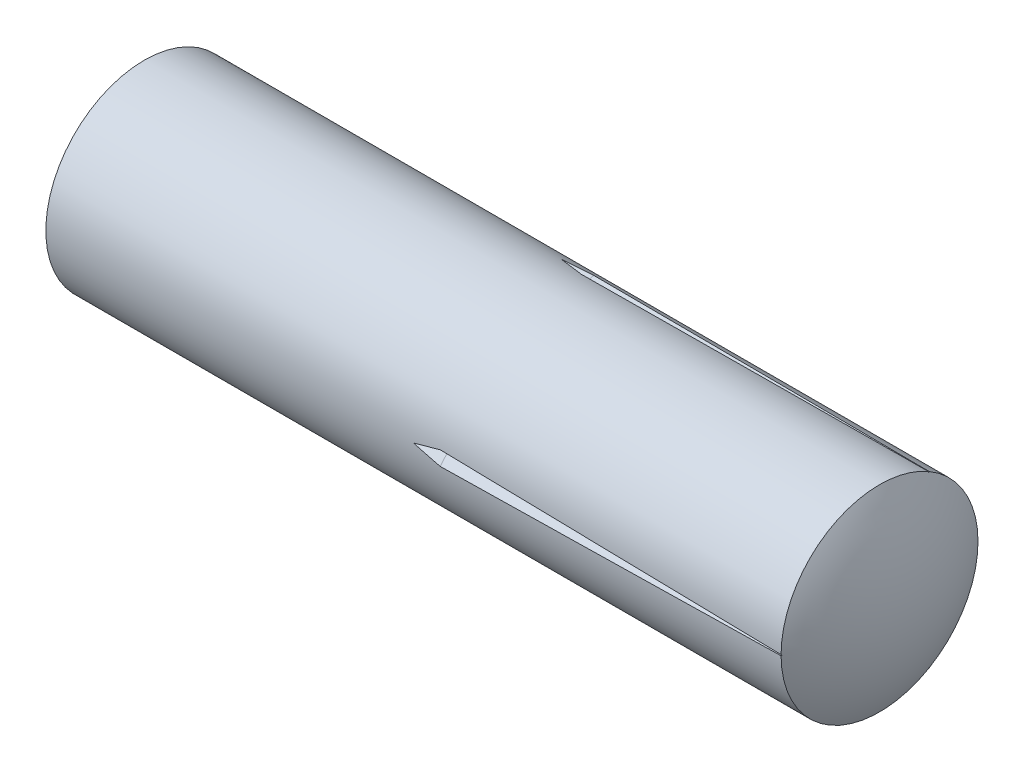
ISO-10303-21;
HEADER;
FILE_DESCRIPTION(('STEP AP214'),'2;1');
FILE_NAME('part.step','',(''),(''),'','','');
FILE_SCHEMA(('AUTOMOTIVE_DESIGN { 1 0 10303 214 1 1 1 1 }'));
ENDSEC;
DATA;
#1=APPLICATION_CONTEXT('core data for automotive mechanical design processes');
#2=APPLICATION_PROTOCOL_DEFINITION('international standard','automotive_design',2000,#1);
#3=PRODUCT_CONTEXT('',#1,'mechanical');
#4=PRODUCT('Part','Part','',(#3));
#5=PRODUCT_RELATED_PRODUCT_CATEGORY('part','',(#4));
#6=PRODUCT_DEFINITION_FORMATION('','',#4);
#7=PRODUCT_DEFINITION_CONTEXT('part definition',#1,'design');
#8=PRODUCT_DEFINITION('design','',#6,#7);
#9=PRODUCT_DEFINITION_SHAPE('','',#8);
#10=(LENGTH_UNIT() NAMED_UNIT(*) SI_UNIT(.MILLI.,.METRE.));
#11=(NAMED_UNIT(*) PLANE_ANGLE_UNIT() SI_UNIT($,.RADIAN.));
#12=(NAMED_UNIT(*) SI_UNIT($,.STERADIAN.) SOLID_ANGLE_UNIT());
#13=UNCERTAINTY_MEASURE_WITH_UNIT(LENGTH_MEASURE(1.E-05),#10,'distance_accuracy_value','');
#14=(GEOMETRIC_REPRESENTATION_CONTEXT(3) GLOBAL_UNCERTAINTY_ASSIGNED_CONTEXT((#13)) GLOBAL_UNIT_ASSIGNED_CONTEXT((#10,
#11,#12)) REPRESENTATION_CONTEXT('',''));
#15=CARTESIAN_POINT('',(0.,0.,0.));
#16=DIRECTION('',(0.,0.,1.));
#17=DIRECTION('',(1.,0.,0.));
#18=AXIS2_PLACEMENT_3D('',#15,#16,#17);
#19=CARTESIAN_POINT('',(-25.0312695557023,0.,0.));
#20=DIRECTION('',(-1.,0.,0.));
#21=DIRECTION('',(0.,1.,0.));
#22=AXIS2_PLACEMENT_3D('',#19,#20,#21);
#23=SPHERICAL_SURFACE('',#22,25.);
#24=CARTESIAN_POINT('',(-50.,0.,0.));
#25=DIRECTION('',(-1.,0.,0.));
#26=DIRECTION('',(0.,0.,1.));
#27=AXIS2_PLACEMENT_3D('',#24,#25,#26);
#28=CIRCLE('',#27,1.25);
#29=CARTESIAN_POINT('',(-50.,1.25000000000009,0.));
#30=VERTEX_POINT('',#29);
#31=EDGE_CURVE('E181',#30,#30,#28,.T.);
#32=CARTESIAN_POINT('',(-46.6819046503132,0.,0.));
#33=DIRECTION('',(-1.,0.,0.));
#34=DIRECTION('',(0.,0.,1.));
#35=AXIS2_PLACEMENT_3D('',#32,#33,#34);
#36=CIRCLE('',#35,12.5);
#37=CARTESIAN_POINT('',(-46.6819046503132,12.5,0.));
#38=VERTEX_POINT('',#37);
#39=EDGE_CURVE('E174',#38,#38,#36,.T.);
#40=CARTESIAN_POINT('',(-50.,1.25000000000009,0.));
#41=CARTESIAN_POINT('',(-49.9938336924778,1.37317333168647,0.));
#42=CARTESIAN_POINT('',(-49.9867558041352,1.49630102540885,0.));
#43=CARTESIAN_POINT('',(-49.9707787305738,1.74243819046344,0.));
#44=CARTESIAN_POINT('',(-49.9618795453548,1.86544766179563,0.));
#45=CARTESIAN_POINT('',(-49.942261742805,2.11132143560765,0.));
#46=CARTESIAN_POINT('',(-49.931543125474,2.23418573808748,0.));
#47=CARTESIAN_POINT('',(-49.9082888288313,2.47974226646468,0.));
#48=CARTESIAN_POINT('',(-49.8957531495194,2.60243449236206,0.));
#49=CARTESIAN_POINT('',(-49.8688674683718,2.84761999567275,0.));
#50=CARTESIAN_POINT('',(-49.854517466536,2.97011327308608,0.));
#51=CARTESIAN_POINT('',(-49.8240062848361,3.21487405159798,0.));
#52=CARTESIAN_POINT('',(-49.8078451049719,3.33714155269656,0.));
#53=CARTESIAN_POINT('',(-49.7737151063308,3.58142400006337,0.));
#54=CARTESIAN_POINT('',(-49.7557462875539,3.70343894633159,0.));
#55=CARTESIAN_POINT('',(-49.718004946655,3.94718956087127,0.));
#56=CARTESIAN_POINT('',(-49.698232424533,4.06892522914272,0.));
#57=CARTESIAN_POINT('',(-49.6568880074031,4.31209062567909,0.));
#58=CARTESIAN_POINT('',(-49.6353161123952,4.433520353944,0.));
#59=CARTESIAN_POINT('',(-49.5903776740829,4.67604727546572,0.));
#60=CARTESIAN_POINT('',(-49.5670111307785,4.79714446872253,0.));
#61=CARTESIAN_POINT('',(-49.5184885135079,5.03897979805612,0.));
#62=CARTESIAN_POINT('',(-49.4933324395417,5.15971793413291,0.));
#63=CARTESIAN_POINT('',(-49.4412362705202,5.40080870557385,0.));
#64=CARTESIAN_POINT('',(-49.414296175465,5.521161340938,0.));
#65=CARTESIAN_POINT('',(-49.3586378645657,5.76145475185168,0.));
#66=CARTESIAN_POINT('',(-49.3299196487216,5.8813955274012,0.));
#67=CARTESIAN_POINT('',(-49.2707113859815,6.12083894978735,0.));
#68=CARTESIAN_POINT('',(-49.2402213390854,6.24034159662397,0.));
#69=CARTESIAN_POINT('',(-49.1774760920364,6.47888258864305,0.));
#70=CARTESIAN_POINT('',(-49.1452208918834,6.59792093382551,0.));
#71=CARTESIAN_POINT('',(-49.078952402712,6.83550725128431,0.));
#72=CARTESIAN_POINT('',(-49.0449391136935,6.95405522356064,0.));
#73=CARTESIAN_POINT('',(-48.9751618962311,7.19063483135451,0.));
#74=CARTESIAN_POINT('',(-48.9393979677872,7.30866646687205,0.));
#75=CARTESIAN_POINT('',(-48.8661273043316,7.54418755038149,0.));
#76=CARTESIAN_POINT('',(-48.8286205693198,7.66167699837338,0.));
#77=CARTESIAN_POINT('',(-48.7518725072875,7.89608797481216,0.));
#78=CARTESIAN_POINT('',(-48.712631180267,8.01300950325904,0.));
#79=CARTESIAN_POINT('',(-48.6324225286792,8.24625903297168,0.));
#80=CARTESIAN_POINT('',(-48.5914552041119,8.36258703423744,0.));
#81=CARTESIAN_POINT('',(-48.5078035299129,8.59462403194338,0.));
#82=CARTESIAN_POINT('',(-48.4651191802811,8.71033302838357,0.));
#83=CARTESIAN_POINT('',(-48.3780428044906,8.94110667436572,0.));
#84=CARTESIAN_POINT('',(-48.3336507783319,9.05617132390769,0.));
#85=CARTESIAN_POINT('',(-48.2431687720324,9.28563107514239,0.));
#86=CARTESIAN_POINT('',(-48.1970787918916,9.40002617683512,0.));
#87=CARTESIAN_POINT('',(-48.1032109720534,9.62812177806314,0.));
#88=CARTESIAN_POINT('',(-48.055433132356,9.74182227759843,0.));
#89=CARTESIAN_POINT('',(-47.9582000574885,9.96850377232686,0.));
#90=CARTESIAN_POINT('',(-47.9087448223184,10.08148476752,0.));
#91=CARTESIAN_POINT('',(-47.8081677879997,10.3067025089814,0.));
#92=CARTESIAN_POINT('',(-47.7570459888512,10.4189392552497,0.));
#93=CARTESIAN_POINT('',(-47.653147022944,10.6426439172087,0.));
#94=CARTESIAN_POINT('',(-47.6003698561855,10.7541118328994,0.));
#95=CARTESIAN_POINT('',(-47.4931717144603,10.9762544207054,0.));
#96=CARTESIAN_POINT('',(-47.4387507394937,11.0869290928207,0.));
#97=CARTESIAN_POINT('',(-47.3282768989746,11.307460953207,0.));
#98=CARTESIAN_POINT('',(-47.272224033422,11.417318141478,0.));
#99=CARTESIAN_POINT('',(-47.1584986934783,11.6361909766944,0.));
#100=CARTESIAN_POINT('',(-47.1008262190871,11.7452066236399,0.));
#101=CARTESIAN_POINT('',(-46.9838742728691,11.9623724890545,0.));
#102=CARTESIAN_POINT('',(-46.9245948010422,12.0705227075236,0.));
#103=CARTESIAN_POINT('',(-46.8044419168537,12.2859340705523,0.));
#104=CARTESIAN_POINT('',(-46.743568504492,12.3931952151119,0.));
#105=CARTESIAN_POINT('',(-46.6819046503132,12.5,0.));
#106=B_SPLINE_CURVE_WITH_KNOTS('',3,(#40,#41,#42,#43,#44,#45,#46,#47,#48,#49,#50,#51,#52,#53,
#54,#55,#56,#57,#58,#59,#60,#61,#62,#63,#64,#65,#66,#67,#68,#69,#70,#71,#72,#73,#74,#75,#76,#77,
#78,#79,#80,#81,#82,#83,#84,#85,#86,#87,#88,#89,#90,#91,#92,#93,#94,#95,#96,#97,#98,#99,#100,
#101,#102,#103,#104,#105),.UNSPECIFIED.,.F.,.F.,(4,2,2,2,2,2,2,2,2,2,2,2,2,2,2,2,2,2,2,2,2,2,2,
2,2,2,2,2,2,2,2,2,4),(0.,0.369979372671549,0.739958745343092,1.10993811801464,1.47991749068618,
1.84989686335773,2.21987623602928,2.58985560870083,2.95983498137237,3.32981435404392,
3.69979372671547,4.06977309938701,4.43975247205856,4.8097318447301,5.17971121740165,
5.5496905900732,5.91966996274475,6.28964933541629,6.65962870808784,7.02960808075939,
7.39958745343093,7.76956682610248,8.13954619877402,8.50952557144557,8.87950494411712,
9.24948431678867,9.61946368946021,9.98944306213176,10.3594224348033,10.7294018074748,
11.0993811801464,11.4693605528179,11.8393399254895),.UNSPECIFIED.);
#107=EDGE_CURVE('BSEAM36',#30,#38,#106,.T.);
#108=ORIENTED_EDGE('',*,*,#31,.F.);
#109=ORIENTED_EDGE('',*,*,#39,.T.);
#110=ORIENTED_EDGE('',*,*,#107,.T.);
#111=ORIENTED_EDGE('',*,*,#107,.F.);
#112=EDGE_LOOP('',(#108,#110,#109,#111));
#113=FACE_BOUND('',#112,.T.);
#114=ADVANCED_FACE('F36',(#113),#23,.T.);
#115=CARTESIAN_POINT('',(-50.,0.,0.));
#116=DIRECTION('',(1.,0.,0.));
#117=DIRECTION('',(0.,0.,-1.));
#118=AXIS2_PLACEMENT_3D('',#115,#116,#117);
#119=PLANE('',#118);
#120=ORIENTED_EDGE('',*,*,#31,.T.);
#121=EDGE_LOOP('',(#120));
#122=FACE_BOUND('',#121,.T.);
#123=ADVANCED_FACE('F238',(#122),#119,.F.);
#124=CARTESIAN_POINT('',(25.,0.,0.));
#125=DIRECTION('',(-1.,0.,0.));
#126=DIRECTION('',(0.,1.,0.));
#127=AXIS2_PLACEMENT_3D('',#124,#125,#126);
#128=SPHERICAL_SURFACE('',#127,25.);
#129=CARTESIAN_POINT('',(46.6506350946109,0.,0.));
#130=DIRECTION('',(-1.,0.,0.));
#131=DIRECTION('',(0.,0.,1.));
#132=AXIS2_PLACEMENT_3D('',#129,#130,#131);
#133=CIRCLE('',#132,12.5);
#134=CARTESIAN_POINT('',(46.6506350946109,10.7915623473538,-6.30810447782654));
#135=VERTEX_POINT('',#134);
#136=CARTESIAN_POINT('',(46.650635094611,-10.7915623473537,-6.30810447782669));
#137=VERTEX_POINT('',#136);
#138=EDGE_CURVE('E182',#135,#137,#133,.T.);
#139=ORIENTED_EDGE('',*,*,#138,.F.);
#140=CARTESIAN_POINT('',(24.8856783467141,6.55604170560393,2.78127333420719));
#141=DIRECTION('',(0.0160507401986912,-0.920467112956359,-0.390490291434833));
#142=DIRECTION('',(0.,0.390540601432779,-0.920585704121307));
#143=AXIS2_PLACEMENT_3D('',#140,#141,#142);
#144=CIRCLE('',#143,23.9639263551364);
#145=CARTESIAN_POINT('',(46.7011859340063,10.7491346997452,-6.20601581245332));
#146=VERTEX_POINT('',#145);
#147=EDGE_CURVE('E141',#135,#146,#144,.T.);
#148=ORIENTED_EDGE('',*,*,#147,.T.);
#149=CARTESIAN_POINT('',(24.8856783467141,0.869367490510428,-7.06833533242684));
#150=DIRECTION('',(0.0160507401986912,-0.122059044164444,0.992393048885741));
#151=DIRECTION('',(0.,-0.992520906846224,-0.122074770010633));
#152=AXIS2_PLACEMENT_3D('',#149,#150,#151);
#153=CIRCLE('',#152,23.9639263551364);
#154=CARTESIAN_POINT('',(46.6506350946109,10.8587599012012,-6.19171490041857));
#155=VERTEX_POINT('',#154);
#156=EDGE_CURVE('E127',#146,#155,#153,.T.);
#157=ORIENTED_EDGE('',*,*,#156,.T.);
#158=CARTESIAN_POINT('',(46.650635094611,0.0671975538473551,12.4998193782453));
#159=VERTEX_POINT('',#158);
#160=EDGE_CURVE('E178',#159,#155,#133,.T.);
#161=ORIENTED_EDGE('',*,*,#160,.F.);
#162=CARTESIAN_POINT('',(24.8856783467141,-5.68667421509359,4.28706199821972));
#163=DIRECTION('',(0.0160507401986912,0.798408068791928,-0.601902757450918));
#164=DIRECTION('',(0.,0.601980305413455,0.798510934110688));
#165=AXIS2_PLACEMENT_3D('',#162,#163,#164);
#166=CIRCLE('',#165,23.9639263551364);
#167=CARTESIAN_POINT('',(46.7011859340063,0.,12.4120316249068));
#168=VERTEX_POINT('',#167);
#169=EDGE_CURVE('E171',#159,#168,#166,.T.);
#170=ORIENTED_EDGE('',*,*,#169,.T.);
#171=CARTESIAN_POINT('',(24.8856783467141,5.6866742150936,4.28706199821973));
#172=DIRECTION('',(0.0160507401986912,-0.798408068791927,-0.601902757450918));
#173=DIRECTION('',(0.,0.601980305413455,-0.798510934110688));
#174=AXIS2_PLACEMENT_3D('',#171,#172,#173);
#175=CIRCLE('',#174,23.9639263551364);
#176=CARTESIAN_POINT('',(46.6506350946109,-0.0671975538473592,12.4998193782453));
#177=VERTEX_POINT('',#176);
#178=EDGE_CURVE('E168',#168,#177,#175,.T.);
#179=ORIENTED_EDGE('',*,*,#178,.T.);
#180=CARTESIAN_POINT('',(46.650635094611,-10.8587599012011,-6.19171490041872));
#181=VERTEX_POINT('',#180);
#182=EDGE_CURVE('E177',#181,#177,#133,.T.);
#183=ORIENTED_EDGE('',*,*,#182,.F.);
#184=CARTESIAN_POINT('',(24.8856783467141,-0.869367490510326,-7.06833533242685));
#185=DIRECTION('',(0.0160507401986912,0.12205904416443,0.992393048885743));
#186=DIRECTION('',(0.,-0.992520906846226,0.122074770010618));
#187=AXIS2_PLACEMENT_3D('',#184,#185,#186);
#188=CIRCLE('',#187,23.9639263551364);
#189=CARTESIAN_POINT('',(46.7011859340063,-10.7491346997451,-6.20601581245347));
#190=VERTEX_POINT('',#189);
#191=EDGE_CURVE('E155',#181,#190,#188,.T.);
#192=ORIENTED_EDGE('',*,*,#191,.T.);
#193=CARTESIAN_POINT('',(24.8856783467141,-6.55604170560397,2.78127333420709));
#194=DIRECTION('',(0.0160507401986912,0.920467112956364,-0.390490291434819));
#195=DIRECTION('',(0.,0.390540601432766,0.920585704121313));
#196=AXIS2_PLACEMENT_3D('',#193,#194,#195);
#197=CIRCLE('',#196,23.9639263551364);
#198=EDGE_CURVE('E152',#190,#137,#197,.T.);
#199=ORIENTED_EDGE('',*,*,#198,.T.);
#200=EDGE_LOOP('',(#139,#148,#157,#161,#170,#179,#183,#192,#199));
#201=FACE_BOUND('',#200,.T.);
#202=ADVANCED_FACE('F212',(#201),#128,.T.);
#203=CARTESIAN_POINT('',(-57.,0.,0.));
#204=DIRECTION('',(-1.,0.,0.));
#205=DIRECTION('',(0.,0.,1.));
#206=AXIS2_PLACEMENT_3D('',#203,#204,#205);
#207=CYLINDRICAL_SURFACE('',#206,12.5);
#208=ORIENTED_EDGE('',*,*,#39,.F.);
#209=EDGE_LOOP('',(#208));
#210=FACE_BOUND('',#209,.T.);
#211=CARTESIAN_POINT('',(31.25,0.,0.));
#212=DIRECTION('',(0.223620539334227,0.883356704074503,0.411915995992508));
#213=DIRECTION('',(-0.974676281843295,0.202669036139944,0.0945061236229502));
#214=AXIS2_PLACEMENT_3D('',#211,#212,#213);
#215=ELLIPSE('',#214,55.8982642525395,12.5);
#216=CARTESIAN_POINT('',(3.34252354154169,10.340007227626,-7.02383446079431));
#217=VERTEX_POINT('',#216);
#218=CARTESIAN_POINT('',(0.,10.8253175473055,-6.2499999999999));
#219=VERTEX_POINT('',#218);
#220=EDGE_CURVE('E137',#217,#219,#215,.T.);
#221=ORIENTED_EDGE('',*,*,#220,.F.);
#222=CARTESIAN_POINT('',(-418.749999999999,0.,0.));
#223=DIRECTION('',(0.0160507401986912,-0.920467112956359,-0.390490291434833));
#224=DIRECTION('',(-0.999871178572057,-0.0147760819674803,-0.00626846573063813));
#225=AXIS2_PLACEMENT_3D('',#222,#223,#224);
#226=ELLIPSE('',#225,778.780283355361,12.5);
#227=EDGE_CURVE('E12',#217,#135,#226,.T.);
#228=ORIENTED_EDGE('',*,*,#227,.T.);
#229=ORIENTED_EDGE('',*,*,#138,.T.);
#230=CARTESIAN_POINT('',(-418.75,0.,0.));
#231=DIRECTION('',(0.0160507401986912,0.920467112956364,-0.390490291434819));
#232=DIRECTION('',(-0.999871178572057,0.0147760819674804,-0.00626846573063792));
#233=AXIS2_PLACEMENT_3D('',#230,#231,#232);
#234=ELLIPSE('',#233,778.780283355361,12.5);
#235=CARTESIAN_POINT('',(3.34252354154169,-10.3400072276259,-7.02383446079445));
#236=VERTEX_POINT('',#235);
#237=EDGE_CURVE('E200',#137,#236,#234,.T.);
#238=ORIENTED_EDGE('',*,*,#237,.T.);
#239=CARTESIAN_POINT('',(31.25,0.,0.));
#240=DIRECTION('',(0.223620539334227,-0.883356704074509,0.411915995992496));
#241=DIRECTION('',(-0.974676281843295,-0.202669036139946,0.0945061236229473));
#242=AXIS2_PLACEMENT_3D('',#239,#240,#241);
#243=ELLIPSE('',#242,55.8982642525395,12.5);
#244=CARTESIAN_POINT('',(0.,-10.8253175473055,-6.25000000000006));
#245=VERTEX_POINT('',#244);
#246=EDGE_CURVE('E196',#245,#236,#243,.T.);
#247=ORIENTED_EDGE('',*,*,#246,.F.);
#248=CARTESIAN_POINT('',(31.25,0.,0.));
#249=DIRECTION('',(0.223620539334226,-0.0849486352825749,-0.970967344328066));
#250=DIRECTION('',(-0.974676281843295,-0.0194898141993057,-0.222769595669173));
#251=AXIS2_PLACEMENT_3D('',#248,#249,#250);
#252=ELLIPSE('',#251,55.8982642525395,12.5);
#253=CARTESIAN_POINT('',(3.34252354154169,-11.2528226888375,-5.44279170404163));
#254=VERTEX_POINT('',#253);
#255=EDGE_CURVE('E198',#254,#245,#252,.T.);
#256=ORIENTED_EDGE('',*,*,#255,.F.);
#257=CARTESIAN_POINT('',(-418.75,0.,0.));
#258=DIRECTION('',(0.0160507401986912,0.12205904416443,0.992393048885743));
#259=DIRECTION('',(-0.999871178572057,0.00195939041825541,0.0159306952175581));
#260=AXIS2_PLACEMENT_3D('',#257,#258,#259);
#261=ELLIPSE('',#260,778.780283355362,12.5);
#262=EDGE_CURVE('E203',#254,#181,#261,.T.);
#263=ORIENTED_EDGE('',*,*,#262,.T.);
#264=ORIENTED_EDGE('',*,*,#182,.T.);
#265=CARTESIAN_POINT('',(-418.749999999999,0.,0.));
#266=DIRECTION('',(0.0160507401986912,-0.798408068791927,-0.601902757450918));
#267=DIRECTION('',(-0.999871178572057,-0.0128166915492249,-0.00966222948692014));
#268=AXIS2_PLACEMENT_3D('',#265,#266,#267);
#269=ELLIPSE('',#268,778.780283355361,12.5);
#270=CARTESIAN_POINT('',(3.34252354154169,-0.912815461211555,12.466626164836));
#271=VERTEX_POINT('',#270);
#272=EDGE_CURVE('E190',#177,#271,#269,.T.);
#273=ORIENTED_EDGE('',*,*,#272,.T.);
#274=CARTESIAN_POINT('',(31.25,0.,0.));
#275=DIRECTION('',(0.223620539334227,0.798408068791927,0.559051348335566));
#276=DIRECTION('',(-0.974676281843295,0.183179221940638,0.128263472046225));
#277=AXIS2_PLACEMENT_3D('',#274,#275,#276);
#278=ELLIPSE('',#277,55.8982642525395,12.5);
#279=CARTESIAN_POINT('',(0.,0.,12.5));
#280=VERTEX_POINT('',#279);
#281=EDGE_CURVE('E185',#280,#271,#278,.T.);
#282=ORIENTED_EDGE('',*,*,#281,.F.);
#283=CARTESIAN_POINT('',(31.25,0.,0.));
#284=DIRECTION('',(0.223620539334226,-0.798408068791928,0.559051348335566));
#285=DIRECTION('',(-0.974676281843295,-0.183179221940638,0.128263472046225));
#286=AXIS2_PLACEMENT_3D('',#283,#284,#285);
#287=ELLIPSE('',#286,55.8982642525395,12.5);
#288=CARTESIAN_POINT('',(3.34252354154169,0.912815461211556,12.466626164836));
#289=VERTEX_POINT('',#288);
#290=EDGE_CURVE('E187',#289,#280,#287,.T.);
#291=ORIENTED_EDGE('',*,*,#290,.F.);
#292=CARTESIAN_POINT('',(-418.75,0.,0.));
#293=DIRECTION('',(0.0160507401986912,0.798408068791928,-0.601902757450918));
#294=DIRECTION('',(-0.999871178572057,0.0128166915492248,-0.00966222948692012));
#295=AXIS2_PLACEMENT_3D('',#292,#293,#294);
#296=ELLIPSE('',#295,778.780283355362,12.5);
#297=EDGE_CURVE('E193',#289,#159,#296,.T.);
#298=ORIENTED_EDGE('',*,*,#297,.T.);
#299=ORIENTED_EDGE('',*,*,#160,.T.);
#300=CARTESIAN_POINT('',(-418.75,0.,0.));
#301=DIRECTION('',(0.0160507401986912,-0.122059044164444,0.992393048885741));
#302=DIRECTION('',(-0.999871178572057,-0.00195939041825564,0.0159306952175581));
#303=AXIS2_PLACEMENT_3D('',#300,#301,#302);
#304=ELLIPSE('',#303,778.780283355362,12.5);
#305=CARTESIAN_POINT('',(3.34252354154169,11.2528226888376,-5.44279170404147));
#306=VERTEX_POINT('',#305);
#307=EDGE_CURVE('E43',#155,#306,#304,.T.);
#308=ORIENTED_EDGE('',*,*,#307,.T.);
#309=CARTESIAN_POINT('',(31.25,0.,0.));
#310=DIRECTION('',(0.223620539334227,0.084948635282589,-0.970967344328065));
#311=DIRECTION('',(-0.974676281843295,0.0194898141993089,-0.222769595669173));
#312=AXIS2_PLACEMENT_3D('',#309,#310,#311);
#313=ELLIPSE('',#312,55.8982642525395,12.5);
#314=EDGE_CURVE('E117',#219,#306,#313,.T.);
#315=ORIENTED_EDGE('',*,*,#314,.F.);
#316=EDGE_LOOP('',(#221,#228,#229,#238,#247,#256,#263,#264,#273,#282,#291,#298,#299,#308,#315));
#317=FACE_BOUND('',#316,.T.);
#318=ADVANCED_FACE('F208',(#210,#317),#207,.T.);
#319=CARTESIAN_POINT('',(3.04669241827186,-0.328609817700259,10.8120195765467));
#320=DIRECTION('',(0.0160507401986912,0.798408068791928,-0.601902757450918));
#321=DIRECTION('',(0.,0.601980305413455,0.798510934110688));
#322=AXIS2_PLACEMENT_3D('',#319,#320,#321);
#323=PLANE('',#322);
#324=ORIENTED_EDGE('',*,*,#297,.F.);
#325=DIRECTION('',(0.141573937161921,0.594100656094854,0.791834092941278));
#326=VECTOR('',#325,1.);
#327=CARTESIAN_POINT('',(3.04669241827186,-0.328609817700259,10.8120195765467));
#328=LINE('',#327,#326);
#329=CARTESIAN_POINT('',(3.125,0.,11.25));
#330=VERTEX_POINT('',#329);
#331=EDGE_CURVE('E159',#330,#289,#328,.T.);
#332=ORIENTED_EDGE('',*,*,#331,.F.);
#333=DIRECTION('',(0.999644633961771,0.,0.0266571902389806));
#334=VECTOR('',#333,1.);
#335=CARTESIAN_POINT('',(3.125,0.,11.25));
#336=LINE('',#335,#334);
#337=EDGE_CURVE('E165',#330,#168,#336,.T.);
#338=ORIENTED_EDGE('',*,*,#337,.T.);
#339=ORIENTED_EDGE('',*,*,#169,.F.);
#340=EDGE_LOOP('',(#324,#332,#338,#339));
#341=FACE_BOUND('',#340,.T.);
#342=ADVANCED_FACE('F249',(#341),#323,.F.);
#343=CARTESIAN_POINT('',(3.04669241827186,0.328609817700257,10.8120195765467));
#344=DIRECTION('',(0.0160507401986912,-0.798408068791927,-0.601902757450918));
#345=DIRECTION('',(0.,0.601980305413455,-0.798510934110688));
#346=AXIS2_PLACEMENT_3D('',#343,#344,#345);
#347=PLANE('',#346);
#348=ORIENTED_EDGE('',*,*,#337,.F.);
#349=DIRECTION('',(-0.141573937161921,0.594100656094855,-0.791834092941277));
#350=VECTOR('',#349,1.);
#351=CARTESIAN_POINT('',(3.04669241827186,0.328609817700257,10.8120195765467));
#352=LINE('',#351,#350);
#353=EDGE_CURVE('E162',#271,#330,#352,.T.);
#354=ORIENTED_EDGE('',*,*,#353,.F.);
#355=ORIENTED_EDGE('',*,*,#272,.F.);
#356=ORIENTED_EDGE('',*,*,#178,.F.);
#357=EDGE_LOOP('',(#348,#354,#355,#356));
#358=FACE_BOUND('',#357,.T.);
#359=ADVANCED_FACE('F255',(#358),#347,.F.);
#360=CARTESIAN_POINT('',(6.28281228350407,0.,9.98687508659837));
#361=DIRECTION('',(0.223620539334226,-0.798408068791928,0.559051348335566));
#362=DIRECTION('',(0.,-0.573576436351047,-0.819152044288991));
#363=AXIS2_PLACEMENT_3D('',#360,#361,#362);
#364=PLANE('',#363);
#365=ORIENTED_EDGE('',*,*,#290,.T.);
#366=DIRECTION('',(-0.928476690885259,0.,0.371390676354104));
#367=VECTOR('',#366,1.);
#368=CARTESIAN_POINT('',(6.28281228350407,0.,9.98687508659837));
#369=LINE('',#368,#367);
#370=EDGE_CURVE('E158',#330,#280,#369,.T.);
#371=ORIENTED_EDGE('',*,*,#370,.F.);
#372=ORIENTED_EDGE('',*,*,#331,.T.);
#373=EDGE_LOOP('',(#365,#371,#372));
#374=FACE_BOUND('',#373,.T.);
#375=ADVANCED_FACE('F261',(#374),#364,.T.);
#376=CARTESIAN_POINT('',(6.28281228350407,0.,9.98687508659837));
#377=DIRECTION('',(0.223620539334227,0.798408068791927,0.559051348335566));
#378=DIRECTION('',(0.,-0.573576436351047,0.819152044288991));
#379=AXIS2_PLACEMENT_3D('',#376,#377,#378);
#380=PLANE('',#379);
#381=ORIENTED_EDGE('',*,*,#281,.T.);
#382=ORIENTED_EDGE('',*,*,#353,.T.);
#383=ORIENTED_EDGE('',*,*,#370,.T.);
#384=EDGE_LOOP('',(#381,#382,#383));
#385=FACE_BOUND('',#384,.T.);
#386=ADVANCED_FACE('F264',(#385),#380,.T.);
#387=CARTESIAN_POINT('',(3.04468501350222,-9.18524341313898,-5.69227573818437));
#388=DIRECTION('',(0.0160507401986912,0.12205904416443,0.992393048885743));
#389=DIRECTION('',(0.,-0.992520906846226,0.122074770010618));
#390=AXIS2_PLACEMENT_3D('',#387,#388,#389);
#391=PLANE('',#390);
#392=ORIENTED_EDGE('',*,*,#262,.F.);
#393=DIRECTION('',(0.141573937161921,-0.982798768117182,0.118589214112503));
#394=VECTOR('',#393,1.);
#395=CARTESIAN_POINT('',(3.04468501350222,-9.18524341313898,-5.69227573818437));
#396=LINE('',#395,#394);
#397=CARTESIAN_POINT('',(3.125,-9.74278579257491,-5.62500000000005));
#398=VERTEX_POINT('',#397);
#399=EDGE_CURVE('E143',#398,#254,#396,.T.);
#400=ORIENTED_EDGE('',*,*,#399,.F.);
#401=DIRECTION('',(0.999644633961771,-0.0230858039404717,-0.0133285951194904));
#402=VECTOR('',#401,1.);
#403=CARTESIAN_POINT('',(3.125,-9.74278579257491,-5.62500000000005));
#404=LINE('',#403,#402);
#405=EDGE_CURVE('E149',#398,#190,#404,.T.);
#406=ORIENTED_EDGE('',*,*,#405,.T.);
#407=ORIENTED_EDGE('',*,*,#191,.F.);
#408=EDGE_LOOP('',(#392,#400,#406,#407));
#409=FACE_BOUND('',#408,.T.);
#410=ADVANCED_FACE('F221',(#409),#391,.F.);
#411=CARTESIAN_POINT('',(3.04468501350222,-9.52227710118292,-5.10851626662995));
#412=DIRECTION('',(0.0160507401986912,0.920467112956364,-0.390490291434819));
#413=DIRECTION('',(0.,0.390540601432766,0.920585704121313));
#414=AXIS2_PLACEMENT_3D('',#411,#412,#413);
#415=PLANE('',#414);
#416=ORIENTED_EDGE('',*,*,#405,.F.);
#417=DIRECTION('',(-0.141573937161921,0.388698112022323,0.910423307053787));
#418=VECTOR('',#417,1.);
#419=CARTESIAN_POINT('',(3.04468501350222,-9.52227710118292,-5.10851626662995));
#420=LINE('',#419,#418);
#421=EDGE_CURVE('E146',#236,#398,#420,.T.);
#422=ORIENTED_EDGE('',*,*,#421,.F.);
#423=ORIENTED_EDGE('',*,*,#237,.F.);
#424=ORIENTED_EDGE('',*,*,#198,.F.);
#425=EDGE_LOOP('',(#416,#422,#423,#424));
#426=FACE_BOUND('',#425,.T.);
#427=ADVANCED_FACE('F218',(#426),#415,.F.);
#428=CARTESIAN_POINT('',(6.36376239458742,-8.62084558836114,-4.97724752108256));
#429=DIRECTION('',(0.223620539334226,-0.0849486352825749,-0.970967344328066));
#430=DIRECTION('',(-0.974489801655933,0.,-0.224431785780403));
#431=AXIS2_PLACEMENT_3D('',#428,#429,#430);
#432=PLANE('',#431);
#433=ORIENTED_EDGE('',*,*,#255,.T.);
#434=DIRECTION('',(-0.928476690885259,-0.321633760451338,-0.185695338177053));
#435=VECTOR('',#434,1.);
#436=CARTESIAN_POINT('',(6.36376239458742,-8.62084558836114,-4.97724752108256));
#437=LINE('',#436,#435);
#438=EDGE_CURVE('E58',#398,#245,#437,.T.);
#439=ORIENTED_EDGE('',*,*,#438,.F.);
#440=ORIENTED_EDGE('',*,*,#399,.T.);
#441=EDGE_LOOP('',(#433,#439,#440));
#442=FACE_BOUND('',#441,.T.);
#443=ADVANCED_FACE('F226',(#442),#432,.T.);
#444=CARTESIAN_POINT('',(6.36376239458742,-8.62084558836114,-4.97724752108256));
#445=DIRECTION('',(0.223620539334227,-0.883356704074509,0.411915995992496));
#446=DIRECTION('',(0.,-0.422618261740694,-0.906307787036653));
#447=AXIS2_PLACEMENT_3D('',#444,#445,#446);
#448=PLANE('',#447);
#449=ORIENTED_EDGE('',*,*,#246,.T.);
#450=ORIENTED_EDGE('',*,*,#421,.T.);
#451=ORIENTED_EDGE('',*,*,#438,.T.);
#452=EDGE_LOOP('',(#449,#450,#451));
#453=FACE_BOUND('',#452,.T.);
#454=ADVANCED_FACE('F228',(#453),#448,.T.);
#455=CARTESIAN_POINT('',(3.04468501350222,9.52227710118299,-5.10851626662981));
#456=DIRECTION('',(0.0160507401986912,-0.920467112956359,-0.390490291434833));
#457=DIRECTION('',(0.,0.390540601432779,-0.920585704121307));
#458=AXIS2_PLACEMENT_3D('',#455,#456,#457);
#459=PLANE('',#458);
#460=ORIENTED_EDGE('',*,*,#227,.F.);
#461=DIRECTION('',(0.141573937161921,0.388698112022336,-0.910423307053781));
#462=VECTOR('',#461,1.);
#463=CARTESIAN_POINT('',(3.04468501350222,9.52227710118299,-5.10851626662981));
#464=LINE('',#463,#462);
#465=CARTESIAN_POINT('',(3.125,9.74278579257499,-5.62499999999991));
#466=VERTEX_POINT('',#465);
#467=EDGE_CURVE('E121',#466,#217,#464,.T.);
#468=ORIENTED_EDGE('',*,*,#467,.F.);
#469=DIRECTION('',(0.999644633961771,0.0230858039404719,-0.0133285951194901));
#470=VECTOR('',#469,1.);
#471=CARTESIAN_POINT('',(3.125,9.74278579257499,-5.62499999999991));
#472=LINE('',#471,#470);
#473=EDGE_CURVE('E120',#466,#146,#472,.T.);
#474=ORIENTED_EDGE('',*,*,#473,.T.);
#475=ORIENTED_EDGE('',*,*,#147,.F.);
#476=EDGE_LOOP('',(#460,#468,#474,#475));
#477=FACE_BOUND('',#476,.T.);
#478=ADVANCED_FACE('F132',(#477),#459,.F.);
#479=CARTESIAN_POINT('',(3.04468501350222,9.18524341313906,-5.69227573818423));
#480=DIRECTION('',(0.0160507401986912,-0.122059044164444,0.992393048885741));
#481=DIRECTION('',(0.,-0.992520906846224,-0.122074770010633));
#482=AXIS2_PLACEMENT_3D('',#479,#480,#481);
#483=PLANE('',#482);
#484=ORIENTED_EDGE('',*,*,#473,.F.);
#485=DIRECTION('',(-0.141573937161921,-0.982798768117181,-0.118589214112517));
#486=VECTOR('',#485,1.);
#487=CARTESIAN_POINT('',(3.04468501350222,9.18524341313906,-5.69227573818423));
#488=LINE('',#487,#486);
#489=EDGE_CURVE('E113',#306,#466,#488,.T.);
#490=ORIENTED_EDGE('',*,*,#489,.F.);
#491=ORIENTED_EDGE('',*,*,#307,.F.);
#492=ORIENTED_EDGE('',*,*,#156,.F.);
#493=EDGE_LOOP('',(#484,#490,#491,#492));
#494=FACE_BOUND('',#493,.T.);
#495=ADVANCED_FACE('F125',(#494),#483,.F.);
#496=CARTESIAN_POINT('',(6.36376239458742,8.62084558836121,-4.97724752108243));
#497=DIRECTION('',(0.223620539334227,0.883356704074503,0.411915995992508));
#498=DIRECTION('',(0.,-0.422618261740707,0.906307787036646));
#499=AXIS2_PLACEMENT_3D('',#496,#497,#498);
#500=PLANE('',#499);
#501=ORIENTED_EDGE('',*,*,#220,.T.);
#502=DIRECTION('',(-0.928476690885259,0.32163376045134,-0.185695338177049));
#503=VECTOR('',#502,1.);
#504=CARTESIAN_POINT('',(6.36376239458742,8.62084558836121,-4.97724752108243));
#505=LINE('',#504,#503);
#506=EDGE_CURVE('E50',#466,#219,#505,.T.);
#507=ORIENTED_EDGE('',*,*,#506,.F.);
#508=ORIENTED_EDGE('',*,*,#467,.T.);
#509=EDGE_LOOP('',(#501,#507,#508));
#510=FACE_BOUND('',#509,.T.);
#511=ADVANCED_FACE('F136',(#510),#500,.T.);
#512=CARTESIAN_POINT('',(6.36376239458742,8.62084558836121,-4.97724752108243));
#513=DIRECTION('',(0.223620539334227,0.084948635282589,-0.970967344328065));
#514=DIRECTION('',(-0.974489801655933,0.,-0.224431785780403));
#515=AXIS2_PLACEMENT_3D('',#512,#513,#514);
#516=PLANE('',#515);
#517=ORIENTED_EDGE('',*,*,#314,.T.);
#518=ORIENTED_EDGE('',*,*,#489,.T.);
#519=ORIENTED_EDGE('',*,*,#506,.T.);
#520=EDGE_LOOP('',(#517,#518,#519));
#521=FACE_BOUND('',#520,.T.);
#522=ADVANCED_FACE('F115',(#521),#516,.T.);
#523=CLOSED_SHELL('',(#114,#123,#202,#318,#342,#359,#375,#386,#410,#427,#443,#454,#478,#495,
#511,#522));
#524=MANIFOLD_SOLID_BREP('B2',#523);
#525=ADVANCED_BREP_SHAPE_REPRESENTATION('',(#18,#524),#14);
#526=SHAPE_DEFINITION_REPRESENTATION(#9,#525);
ENDSEC;
END-ISO-10303-21;
